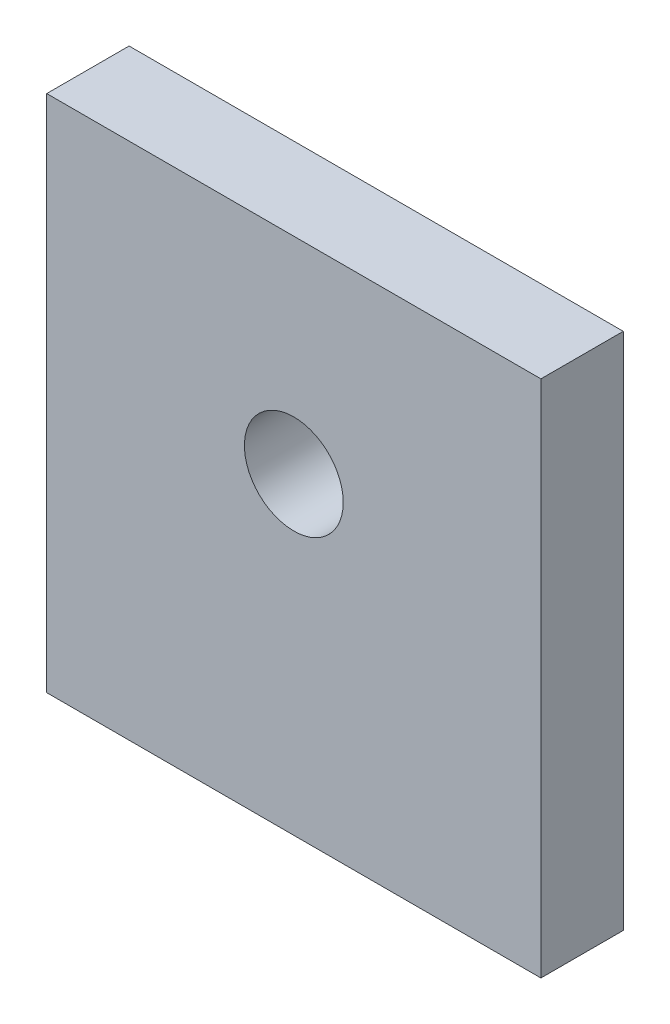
ISO-10303-21;
HEADER;
FILE_DESCRIPTION(('STEP AP214'),'2;1');
FILE_NAME('part.step','',(''),(''),'','','');
FILE_SCHEMA(('AUTOMOTIVE_DESIGN { 1 0 10303 214 1 1 1 1 }'));
ENDSEC;
DATA;
#1=APPLICATION_CONTEXT('core data for automotive mechanical design processes');
#2=APPLICATION_PROTOCOL_DEFINITION('international standard','automotive_design',2000,#1);
#3=PRODUCT_CONTEXT('',#1,'mechanical');
#4=PRODUCT('Part','Part','',(#3));
#5=PRODUCT_RELATED_PRODUCT_CATEGORY('part','',(#4));
#6=PRODUCT_DEFINITION_FORMATION('','',#4);
#7=PRODUCT_DEFINITION_CONTEXT('part definition',#1,'design');
#8=PRODUCT_DEFINITION('design','',#6,#7);
#9=PRODUCT_DEFINITION_SHAPE('','',#8);
#10=(LENGTH_UNIT() NAMED_UNIT(*) SI_UNIT(.MILLI.,.METRE.));
#11=(NAMED_UNIT(*) PLANE_ANGLE_UNIT() SI_UNIT($,.RADIAN.));
#12=(NAMED_UNIT(*) SI_UNIT($,.STERADIAN.) SOLID_ANGLE_UNIT());
#13=UNCERTAINTY_MEASURE_WITH_UNIT(LENGTH_MEASURE(1.E-05),#10,'distance_accuracy_value','');
#14=(GEOMETRIC_REPRESENTATION_CONTEXT(3) GLOBAL_UNCERTAINTY_ASSIGNED_CONTEXT((#13)) GLOBAL_UNIT_ASSIGNED_CONTEXT((#10,
#11,#12)) REPRESENTATION_CONTEXT('',''));
#15=CARTESIAN_POINT('',(0.,0.,0.));
#16=DIRECTION('',(0.,0.,1.));
#17=DIRECTION('',(1.,0.,0.));
#18=AXIS2_PLACEMENT_3D('',#15,#16,#17);
#19=CARTESIAN_POINT('',(0.,0.,10.));
#20=DIRECTION('',(0.,0.,-1.));
#21=DIRECTION('',(-1.,0.,0.));
#22=AXIS2_PLACEMENT_3D('',#19,#20,#21);
#23=PLANE('',#22);
#24=DIRECTION('',(0.,1.,0.));
#25=VECTOR('',#24,1.);
#26=CARTESIAN_POINT('',(30.,-31.5,10.));
#27=LINE('',#26,#25);
#28=CARTESIAN_POINT('',(30.,-31.5,10.));
#29=VERTEX_POINT('',#28);
#30=CARTESIAN_POINT('',(30.,31.5,10.));
#31=VERTEX_POINT('',#30);
#32=EDGE_CURVE('E85',#29,#31,#27,.T.);
#33=ORIENTED_EDGE('',*,*,#32,.T.);
#34=DIRECTION('',(-1.,0.,0.));
#35=VECTOR('',#34,1.);
#36=CARTESIAN_POINT('',(-30.,31.5,10.));
#37=LINE('',#36,#35);
#38=CARTESIAN_POINT('',(-30.,31.5,10.));
#39=VERTEX_POINT('',#38);
#40=EDGE_CURVE('E80',#31,#39,#37,.T.);
#41=ORIENTED_EDGE('',*,*,#40,.T.);
#42=DIRECTION('',(0.,-1.,0.));
#43=VECTOR('',#42,1.);
#44=CARTESIAN_POINT('',(-30.,-31.5,10.));
#45=LINE('',#44,#43);
#46=CARTESIAN_POINT('',(-30.,-31.5,10.));
#47=VERTEX_POINT('',#46);
#48=EDGE_CURVE('E83',#39,#47,#45,.T.);
#49=ORIENTED_EDGE('',*,*,#48,.T.);
#50=DIRECTION('',(1.,0.,0.));
#51=VECTOR('',#50,1.);
#52=CARTESIAN_POINT('',(-30.,-31.5,10.));
#53=LINE('',#52,#51);
#54=EDGE_CURVE('E50',#47,#29,#53,.T.);
#55=ORIENTED_EDGE('',*,*,#54,.T.);
#56=EDGE_LOOP('',(#33,#41,#49,#55));
#57=FACE_BOUND('',#56,.T.);
#58=CARTESIAN_POINT('',(0.,6.5,10.));
#59=DIRECTION('',(0.,0.,1.));
#60=DIRECTION('',(1.,0.,0.));
#61=AXIS2_PLACEMENT_3D('',#58,#59,#60);
#62=CIRCLE('',#61,6.);
#63=CARTESIAN_POINT('',(6.,6.5,10.));
#64=VERTEX_POINT('',#63);
#65=EDGE_CURVE('E100',#64,#64,#62,.T.);
#66=ORIENTED_EDGE('',*,*,#65,.F.);
#67=EDGE_LOOP('',(#66));
#68=FACE_BOUND('',#67,.T.);
#69=ADVANCED_FACE('F33',(#57,#68),#23,.F.);
#70=CARTESIAN_POINT('',(0.,0.,0.));
#71=DIRECTION('',(0.,0.,-1.));
#72=DIRECTION('',(-1.,0.,0.));
#73=AXIS2_PLACEMENT_3D('',#70,#71,#72);
#74=PLANE('',#73);
#75=DIRECTION('',(0.,1.,0.));
#76=VECTOR('',#75,1.);
#77=CARTESIAN_POINT('',(30.,-31.5,0.));
#78=LINE('',#77,#76);
#79=CARTESIAN_POINT('',(30.,-31.5,0.));
#80=VERTEX_POINT('',#79);
#81=CARTESIAN_POINT('',(30.,31.5,0.));
#82=VERTEX_POINT('',#81);
#83=EDGE_CURVE('E97',#80,#82,#78,.T.);
#84=ORIENTED_EDGE('',*,*,#83,.F.);
#85=DIRECTION('',(1.,0.,0.));
#86=VECTOR('',#85,1.);
#87=CARTESIAN_POINT('',(-30.,-31.5,0.));
#88=LINE('',#87,#86);
#89=CARTESIAN_POINT('',(-30.,-31.5,0.));
#90=VERTEX_POINT('',#89);
#91=EDGE_CURVE('E73',#90,#80,#88,.T.);
#92=ORIENTED_EDGE('',*,*,#91,.F.);
#93=DIRECTION('',(0.,-1.,0.));
#94=VECTOR('',#93,1.);
#95=CARTESIAN_POINT('',(-30.,-31.5,0.));
#96=LINE('',#95,#94);
#97=CARTESIAN_POINT('',(-30.,31.5,0.));
#98=VERTEX_POINT('',#97);
#99=EDGE_CURVE('E67',#98,#90,#96,.T.);
#100=ORIENTED_EDGE('',*,*,#99,.F.);
#101=DIRECTION('',(-1.,0.,0.));
#102=VECTOR('',#101,1.);
#103=CARTESIAN_POINT('',(-30.,31.5,0.));
#104=LINE('',#103,#102);
#105=EDGE_CURVE('E89',#82,#98,#104,.T.);
#106=ORIENTED_EDGE('',*,*,#105,.F.);
#107=EDGE_LOOP('',(#84,#92,#100,#106));
#108=FACE_BOUND('',#107,.T.);
#109=CARTESIAN_POINT('',(0.,6.5,0.));
#110=DIRECTION('',(0.,0.,1.));
#111=DIRECTION('',(1.,0.,0.));
#112=AXIS2_PLACEMENT_3D('',#109,#110,#111);
#113=CIRCLE('',#112,6.);
#114=CARTESIAN_POINT('',(6.,6.5,0.));
#115=VERTEX_POINT('',#114);
#116=EDGE_CURVE('E112',#115,#115,#113,.T.);
#117=ORIENTED_EDGE('',*,*,#116,.T.);
#118=EDGE_LOOP('',(#117));
#119=FACE_BOUND('',#118,.T.);
#120=ADVANCED_FACE('F108',(#108,#119),#74,.T.);
#121=CARTESIAN_POINT('',(30.,-31.5,10.));
#122=DIRECTION('',(-1.,0.,0.));
#123=DIRECTION('',(0.,0.,1.));
#124=AXIS2_PLACEMENT_3D('',#121,#122,#123);
#125=PLANE('',#124);
#126=ORIENTED_EDGE('',*,*,#83,.T.);
#127=DIRECTION('',(0.,0.,-1.));
#128=VECTOR('',#127,1.);
#129=CARTESIAN_POINT('',(30.,31.5,10.));
#130=LINE('',#129,#128);
#131=EDGE_CURVE('E11',#31,#82,#130,.T.);
#132=ORIENTED_EDGE('',*,*,#131,.F.);
#133=ORIENTED_EDGE('',*,*,#32,.F.);
#134=DIRECTION('',(0.,0.,-1.));
#135=VECTOR('',#134,1.);
#136=CARTESIAN_POINT('',(30.,-31.5,10.));
#137=LINE('',#136,#135);
#138=EDGE_CURVE('E93',#29,#80,#137,.T.);
#139=ORIENTED_EDGE('',*,*,#138,.T.);
#140=EDGE_LOOP('',(#126,#132,#133,#139));
#141=FACE_BOUND('',#140,.T.);
#142=ADVANCED_FACE('F35',(#141),#125,.F.);
#143=CARTESIAN_POINT('',(-30.,31.5,10.));
#144=DIRECTION('',(0.,-1.,0.));
#145=DIRECTION('',(0.,0.,-1.));
#146=AXIS2_PLACEMENT_3D('',#143,#144,#145);
#147=PLANE('',#146);
#148=ORIENTED_EDGE('',*,*,#105,.T.);
#149=DIRECTION('',(0.,0.,-1.));
#150=VECTOR('',#149,1.);
#151=CARTESIAN_POINT('',(-30.,31.5,10.));
#152=LINE('',#151,#150);
#153=EDGE_CURVE('E42',#39,#98,#152,.T.);
#154=ORIENTED_EDGE('',*,*,#153,.F.);
#155=ORIENTED_EDGE('',*,*,#40,.F.);
#156=ORIENTED_EDGE('',*,*,#131,.T.);
#157=EDGE_LOOP('',(#148,#154,#155,#156));
#158=FACE_BOUND('',#157,.T.);
#159=ADVANCED_FACE('F88',(#158),#147,.F.);
#160=CARTESIAN_POINT('',(-30.,-31.5,10.));
#161=DIRECTION('',(1.,0.,0.));
#162=DIRECTION('',(0.,0.,-1.));
#163=AXIS2_PLACEMENT_3D('',#160,#161,#162);
#164=PLANE('',#163);
#165=ORIENTED_EDGE('',*,*,#99,.T.);
#166=DIRECTION('',(0.,0.,-1.));
#167=VECTOR('',#166,1.);
#168=CARTESIAN_POINT('',(-30.,-31.5,10.));
#169=LINE('',#168,#167);
#170=EDGE_CURVE('E90',#47,#90,#169,.T.);
#171=ORIENTED_EDGE('',*,*,#170,.F.);
#172=ORIENTED_EDGE('',*,*,#48,.F.);
#173=ORIENTED_EDGE('',*,*,#153,.T.);
#174=EDGE_LOOP('',(#165,#171,#172,#173));
#175=FACE_BOUND('',#174,.T.);
#176=ADVANCED_FACE('F91',(#175),#164,.F.);
#177=CARTESIAN_POINT('',(-30.,-31.5,10.));
#178=DIRECTION('',(0.,1.,0.));
#179=DIRECTION('',(0.,0.,1.));
#180=AXIS2_PLACEMENT_3D('',#177,#178,#179);
#181=PLANE('',#180);
#182=ORIENTED_EDGE('',*,*,#91,.T.);
#183=ORIENTED_EDGE('',*,*,#138,.F.);
#184=ORIENTED_EDGE('',*,*,#54,.F.);
#185=ORIENTED_EDGE('',*,*,#170,.T.);
#186=EDGE_LOOP('',(#182,#183,#184,#185));
#187=FACE_BOUND('',#186,.T.);
#188=ADVANCED_FACE('F105',(#187),#181,.F.);
#189=CARTESIAN_POINT('',(0.,6.5,10.));
#190=DIRECTION('',(0.,0.,-1.));
#191=DIRECTION('',(-1.,0.,0.));
#192=AXIS2_PLACEMENT_3D('',#189,#190,#191);
#193=CYLINDRICAL_SURFACE('',#192,6.);
#194=ORIENTED_EDGE('',*,*,#65,.T.);
#195=EDGE_LOOP('',(#194));
#196=FACE_BOUND('',#195,.T.);
#197=ORIENTED_EDGE('',*,*,#116,.F.);
#198=EDGE_LOOP('',(#197));
#199=FACE_BOUND('',#198,.T.);
#200=ADVANCED_FACE('F118',(#196,#199),#193,.F.);
#201=CLOSED_SHELL('',(#69,#120,#142,#159,#176,#188,#200));
#202=MANIFOLD_SOLID_BREP('B2',#201);
#203=ADVANCED_BREP_SHAPE_REPRESENTATION('',(#18,#202),#14);
#204=SHAPE_DEFINITION_REPRESENTATION(#9,#203);
ENDSEC;
END-ISO-10303-21;
